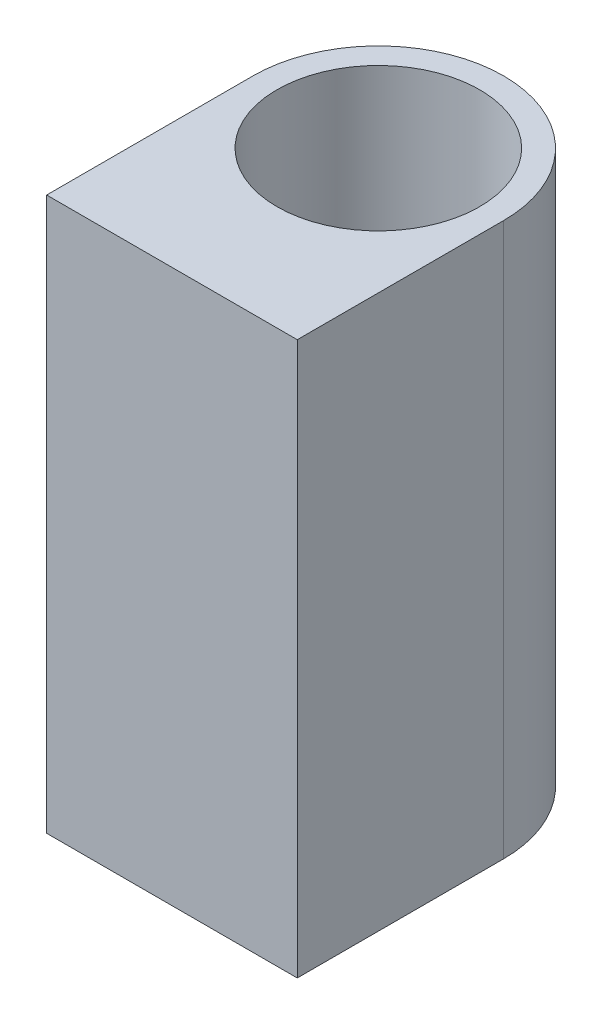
from build123d import *

# Parameters (mm, degrees)
SALIENTE_EXTRUIR1_DEPTH = 150
CROQUIS2_R              = 27.5
CORTAR_EXTRUIR1_DEPTH   = 70
CORTAR_EXTRUIR2_START   = -70
CROQUIS3_R              = 27.5
CORTAR_EXTRUIR2_DEPTH   = 70


with BuildPart() as part:
    # Croquis1 → Saliente-Extruir1 (new body)
    with BuildSketch(Plane(origin=(0, 0, 0), x_dir=(1, 0, 0), z_dir=(0, 1, 0))):
        with BuildLine():
            Line((34, 0), (-34, 0))
            Line((-34, 0), (-34, 56))
            ThreePointArc((-34, 56), (0, 90), (34, 56))
            Line((34, 56), (34, 0))
        make_face()
    extrude(amount=SALIENTE_EXTRUIR1_DEPTH)

    # Croquis2 → Cortar-Extruir1 (cut)
    with BuildSketch(Plane(origin=(0, 150, 0), x_dir=(1, 0, 0), z_dir=(0, 1, 0))):
        with Locations(Location((0, 56, 0), (0, 0, 270))):
            Circle(CROQUIS2_R)
    extrude(amount=-CORTAR_EXTRUIR1_DEPTH, mode=Mode.SUBTRACT)

    # Croquis3 → Cortar-Extruir2 (cut)
    with BuildSketch(Plane.XZ.offset(CORTAR_EXTRUIR2_START)):
        with Locations(Location((0, -56, 0), (0, 0, 90))):
            Circle(CROQUIS3_R)
    extrude(amount=CORTAR_EXTRUIR2_DEPTH, mode=Mode.SUBTRACT)


solid = part.part
